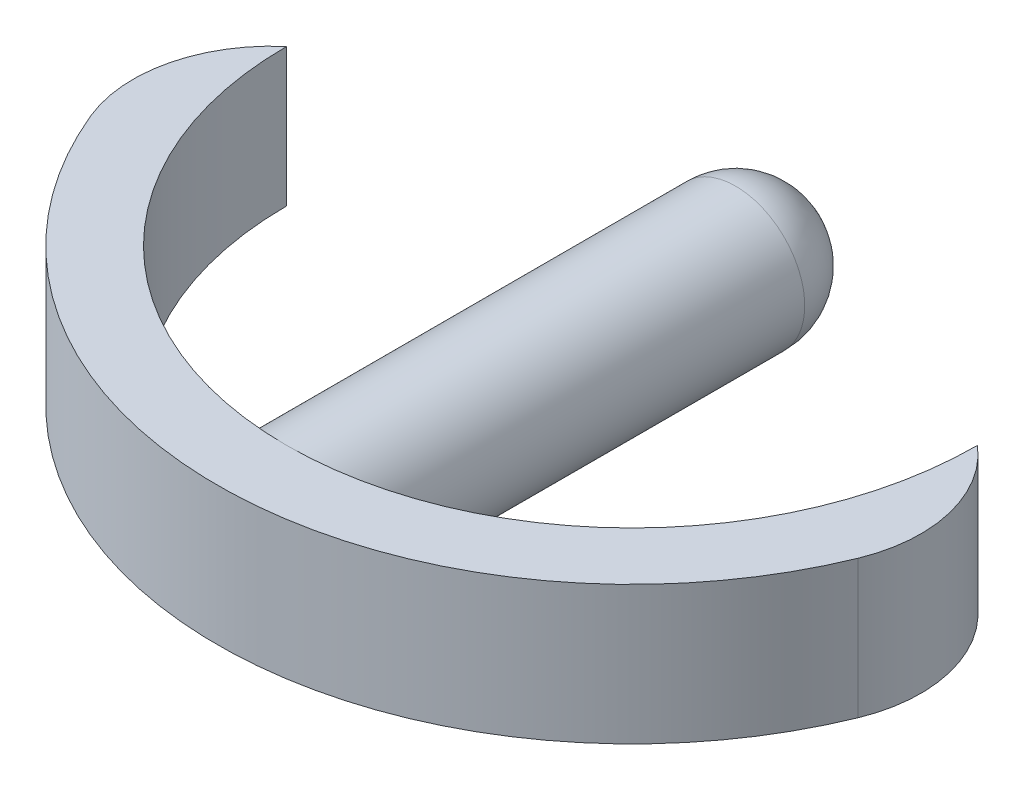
ISO-10303-21;
HEADER;
FILE_DESCRIPTION(('STEP AP214'),'2;1');
FILE_NAME('part.step','',(''),(''),'','','');
FILE_SCHEMA(('AUTOMOTIVE_DESIGN { 1 0 10303 214 1 1 1 1 }'));
ENDSEC;
DATA;
#1=APPLICATION_CONTEXT('core data for automotive mechanical design processes');
#2=APPLICATION_PROTOCOL_DEFINITION('international standard','automotive_design',2000,#1);
#3=PRODUCT_CONTEXT('',#1,'mechanical');
#4=PRODUCT('Part','Part','',(#3));
#5=PRODUCT_RELATED_PRODUCT_CATEGORY('part','',(#4));
#6=PRODUCT_DEFINITION_FORMATION('','',#4);
#7=PRODUCT_DEFINITION_CONTEXT('part definition',#1,'design');
#8=PRODUCT_DEFINITION('design','',#6,#7);
#9=PRODUCT_DEFINITION_SHAPE('','',#8);
#10=(LENGTH_UNIT() NAMED_UNIT(*) SI_UNIT(.MILLI.,.METRE.));
#11=(NAMED_UNIT(*) PLANE_ANGLE_UNIT() SI_UNIT($,.RADIAN.));
#12=(NAMED_UNIT(*) SI_UNIT($,.STERADIAN.) SOLID_ANGLE_UNIT());
#13=UNCERTAINTY_MEASURE_WITH_UNIT(LENGTH_MEASURE(1.E-05),#10,'distance_accuracy_value','');
#14=(GEOMETRIC_REPRESENTATION_CONTEXT(3) GLOBAL_UNCERTAINTY_ASSIGNED_CONTEXT((#13)) GLOBAL_UNIT_ASSIGNED_CONTEXT((#10,
#11,#12)) REPRESENTATION_CONTEXT('',''));
#15=CARTESIAN_POINT('',(0.,0.,0.));
#16=DIRECTION('',(0.,0.,1.));
#17=DIRECTION('',(1.,0.,0.));
#18=AXIS2_PLACEMENT_3D('',#15,#16,#17);
#19=CARTESIAN_POINT('',(0.,0.,0.));
#20=DIRECTION('',(0.,1.,0.));
#21=DIRECTION('',(0.,0.,1.));
#22=AXIS2_PLACEMENT_3D('',#19,#20,#21);
#23=CYLINDRICAL_SURFACE('',#22,6.35);
#24=CARTESIAN_POINT('',(0.,0.,6.35));
#25=CARTESIAN_POINT('',(-0.0705826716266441,2.59651289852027E-06,6.34999869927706));
#26=CARTESIAN_POINT('',(-0.141198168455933,0.00590403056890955,6.34881109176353));
#27=CARTESIAN_POINT('',(-0.280433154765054,0.0293350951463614,6.34418804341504));
#28=CARTESIAN_POINT('',(-0.349051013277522,0.0468739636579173,6.34075081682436));
#29=CARTESIAN_POINT('',(-0.482257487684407,0.0930164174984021,6.33201234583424));
#30=CARTESIAN_POINT('',(-0.54684989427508,0.121609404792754,6.32671288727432));
#31=CARTESIAN_POINT('',(-0.670316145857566,0.189016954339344,6.31482605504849));
#32=CARTESIAN_POINT('',(-0.729190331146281,0.227830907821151,6.30823875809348));
#33=CARTESIAN_POINT('',(-0.840350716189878,0.315135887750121,6.29440149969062));
#34=CARTESIAN_POINT('',(-0.892548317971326,0.363738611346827,6.28714446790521));
#35=CARTESIAN_POINT('',(-0.988106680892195,0.469001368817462,6.27283709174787));
#36=CARTESIAN_POINT('',(-1.03146675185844,0.5256620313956,6.26578676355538));
#37=CARTESIAN_POINT('',(-1.10849632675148,0.646069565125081,6.25262201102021));
#38=CARTESIAN_POINT('',(-1.14207409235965,0.709876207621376,6.24651668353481));
#39=CARTESIAN_POINT('',(-1.19799819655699,0.842367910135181,6.23603360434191));
#40=CARTESIAN_POINT('',(-1.22034564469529,0.911052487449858,6.23165568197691));
#41=CARTESIAN_POINT('',(-1.25288713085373,1.05039714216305,6.225194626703));
#42=CARTESIAN_POINT('',(-1.26323661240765,1.12101953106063,6.22308217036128));
#43=CARTESIAN_POINT('',(-1.27197120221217,1.26302747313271,6.22130296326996));
#44=CARTESIAN_POINT('',(-1.27035753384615,1.33441294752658,6.22163596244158));
#45=CARTESIAN_POINT('',(-1.25533730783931,1.47478342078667,6.22468339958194));
#46=CARTESIAN_POINT('',(-1.24210894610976,1.54378838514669,6.2273618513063));
#47=CARTESIAN_POINT('',(-1.20451611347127,1.67857941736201,6.23474173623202));
#48=CARTESIAN_POINT('',(-1.18015111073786,1.74436533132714,6.23944326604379));
#49=CARTESIAN_POINT('',(-1.12080647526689,1.87136438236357,6.25037635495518));
#50=CARTESIAN_POINT('',(-1.08575621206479,1.93254360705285,6.25661804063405));
#51=CARTESIAN_POINT('',(-1.0060858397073,2.04821897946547,6.26992165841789));
#52=CARTESIAN_POINT('',(-0.961464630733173,2.10271435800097,6.27698368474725));
#53=CARTESIAN_POINT('',(-0.862964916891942,2.20450334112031,6.29128816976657));
#54=CARTESIAN_POINT('',(-0.808934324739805,2.2516497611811,6.29853158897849));
#55=CARTESIAN_POINT('',(-0.693654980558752,2.33623338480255,6.31226637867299));
#56=CARTESIAN_POINT('',(-0.632406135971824,2.37367046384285,6.31875773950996));
#57=CARTESIAN_POINT('',(-0.504265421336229,2.43779993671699,6.33027296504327));
#58=CARTESIAN_POINT('',(-0.437364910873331,2.46447550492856,6.33529452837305));
#59=CARTESIAN_POINT('',(-0.299909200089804,2.50616780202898,6.3432868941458));
#60=CARTESIAN_POINT('',(-0.229354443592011,2.52118594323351,6.34625794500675));
#61=CARTESIAN_POINT('',(-0.0878578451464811,2.53892869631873,6.34977993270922));
#62=CARTESIAN_POINT('',(-0.0169422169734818,2.54185473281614,6.35037051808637));
#63=CARTESIAN_POINT('',(0.124364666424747,2.53587267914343,6.3491751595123));
#64=CARTESIAN_POINT('',(0.194755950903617,2.5269652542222,6.34738934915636));
#65=CARTESIAN_POINT('',(0.332366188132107,2.49773646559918,6.34166666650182));
#66=CARTESIAN_POINT('',(0.399607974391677,2.47751845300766,6.33774928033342));
#67=CARTESIAN_POINT('',(0.529747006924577,2.42635534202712,6.32820111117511));
#68=CARTESIAN_POINT('',(0.592643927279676,2.39540943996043,6.32257019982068));
#69=CARTESIAN_POINT('',(0.713157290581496,2.32323323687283,6.31012087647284));
#70=CARTESIAN_POINT('',(0.770699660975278,2.28188166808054,6.30328877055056));
#71=CARTESIAN_POINT('',(0.878100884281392,2.19023032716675,6.28922713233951));
#72=CARTESIAN_POINT('',(0.927958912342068,2.13992959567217,6.28199755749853));
#73=CARTESIAN_POINT('',(1.0193535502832,2.03089084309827,6.26782215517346));
#74=CARTESIAN_POINT('',(1.06075188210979,1.9720360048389,6.26088232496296));
#75=CARTESIAN_POINT('',(1.13307548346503,1.84808957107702,6.24819923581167));
#76=CARTESIAN_POINT('',(1.16400117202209,1.78299822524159,6.24245592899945));
#77=CARTESIAN_POINT('',(1.21431283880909,1.64875432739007,6.23286460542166));
#78=CARTESIAN_POINT('',(1.23375864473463,1.57962493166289,6.22900678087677));
#79=CARTESIAN_POINT('',(1.26073998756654,1.43899451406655,6.22360244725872));
#80=CARTESIAN_POINT('',(1.26827707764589,1.36749380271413,6.22205563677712));
#81=CARTESIAN_POINT('',(1.27116955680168,1.22553874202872,6.22146520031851));
#82=CARTESIAN_POINT('',(1.26674345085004,1.1550889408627,6.22237667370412));
#83=CARTESIAN_POINT('',(1.24631742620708,1.01595980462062,6.22649978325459));
#84=CARTESIAN_POINT('',(1.23031760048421,0.947280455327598,6.22971140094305));
#85=CARTESIAN_POINT('',(1.18729578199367,0.813780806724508,6.23805285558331));
#86=CARTESIAN_POINT('',(1.16030058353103,0.748951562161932,6.24317802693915));
#87=CARTESIAN_POINT('',(1.09607939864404,0.62470827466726,6.25477178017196));
#88=CARTESIAN_POINT('',(1.0588525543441,0.565294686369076,6.26124047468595));
#89=CARTESIAN_POINT('',(0.974478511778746,0.452481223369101,6.27492979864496));
#90=CARTESIAN_POINT('',(0.927173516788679,0.399200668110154,6.28216133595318));
#91=CARTESIAN_POINT('',(0.824311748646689,0.301261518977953,6.29648323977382));
#92=CARTESIAN_POINT('',(0.768753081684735,0.256604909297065,6.30357357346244));
#93=CARTESIAN_POINT('',(0.650262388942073,0.176740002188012,6.31690167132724));
#94=CARTESIAN_POINT('',(0.58725928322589,0.141635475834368,6.32312973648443));
#95=CARTESIAN_POINT('',(0.45614127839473,0.0825676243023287,6.3339360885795));
#96=CARTESIAN_POINT('',(0.38803105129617,0.0585942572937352,6.33851586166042));
#97=CARTESIAN_POINT('',(0.2664732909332,0.0271120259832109,6.34461993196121));
#98=CARTESIAN_POINT('',(0.213717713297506,0.0169631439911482,6.34662565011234));
#99=CARTESIAN_POINT('',(0.107314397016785,0.00340625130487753,6.34931615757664));
#100=CARTESIAN_POINT('',(0.0536666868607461,-1.97422740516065E-06,6.35000098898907));
#101=CARTESIAN_POINT('',(0.,0.,6.35));
#102=B_SPLINE_CURVE_WITH_KNOTS('',3,(#24,#25,#26,#27,#28,#29,#30,#31,#32,#33,#34,#35,#36,#37,
#38,#39,#40,#41,#42,#43,#44,#45,#46,#47,#48,#49,#50,#51,#52,#53,#54,#55,#56,#57,#58,#59,#60,#61,
#62,#63,#64,#65,#66,#67,#68,#69,#70,#71,#72,#73,#74,#75,#76,#77,#78,#79,#80,#81,#82,#83,#84,#85,
#86,#87,#88,#89,#90,#91,#92,#93,#94,#95,#96,#97,#98,#99,#100,#101),.UNSPECIFIED.,.T.,.F.,(4,2,2,
2,2,2,2,2,2,2,2,2,2,2,2,2,2,2,2,2,2,2,2,2,2,2,2,2,2,2,2,2,2,2,2,2,2,2,4),(0.,0.211551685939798,
0.42327150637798,0.634788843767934,0.846293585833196,1.06036449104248,1.27445210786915,
1.49048717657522,1.70650089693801,1.91968355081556,2.13284440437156,2.34279093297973,
2.55274748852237,2.76412312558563,2.97552306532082,3.19072580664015,3.40593130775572,
3.6214719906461,3.83698655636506,4.04889634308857,4.26079421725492,4.47078676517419,
4.68079504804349,4.89337433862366,5.10597643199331,5.32181598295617,5.53764689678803,
5.75234283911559,5.96701077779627,6.17778447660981,6.38855648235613,6.5988179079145,
6.80909696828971,7.02294856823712,7.23684931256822,7.45298860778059,7.66893253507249,
7.82978844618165,7.99063923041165),.UNSPECIFIED.);
#103=CARTESIAN_POINT('',(0.,0.,6.35));
#104=VERTEX_POINT('',#103);
#105=CARTESIAN_POINT('',(0.,2.54,6.35));
#106=VERTEX_POINT('',#105);
#107=EDGE_CURVE('E41',#104,#106,#102,.T.);
#108=ORIENTED_EDGE('',*,*,#107,.F.);
#109=CARTESIAN_POINT('',(0.,0.,0.));
#110=DIRECTION('',(0.,1.,0.));
#111=DIRECTION('',(0.,0.,1.));
#112=AXIS2_PLACEMENT_3D('',#109,#110,#111);
#113=CIRCLE('',#112,6.35);
#114=CARTESIAN_POINT('',(-6.35,0.,0.));
#115=VERTEX_POINT('',#114);
#116=EDGE_CURVE('E80',#115,#104,#113,.T.);
#117=ORIENTED_EDGE('',*,*,#116,.F.);
#118=DIRECTION('',(0.,1.,0.));
#119=VECTOR('',#118,1.);
#120=CARTESIAN_POINT('',(-6.35,0.,0.));
#121=LINE('',#120,#119);
#122=CARTESIAN_POINT('',(-6.35,2.54,0.));
#123=VERTEX_POINT('',#122);
#124=EDGE_CURVE('E135',#123,#115,#121,.F.);
#125=ORIENTED_EDGE('',*,*,#124,.F.);
#126=CARTESIAN_POINT('',(0.,2.54,0.));
#127=DIRECTION('',(0.,1.,0.));
#128=DIRECTION('',(0.,0.,1.));
#129=AXIS2_PLACEMENT_3D('',#126,#127,#128);
#130=CIRCLE('',#129,6.35);
#131=EDGE_CURVE('E95',#123,#106,#130,.T.);
#132=ORIENTED_EDGE('',*,*,#131,.T.);
#133=EDGE_LOOP('',(#108,#117,#125,#132));
#134=FACE_BOUND('',#133,.T.);
#135=ADVANCED_FACE('F33',(#134),#23,.F.);
#136=CARTESIAN_POINT('',(-1.27,1.27,6.22170394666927));
#137=CARTESIAN_POINT('',(-1.26999739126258,1.19943324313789,6.22170534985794));
#138=CARTESIAN_POINT('',(-1.26409852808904,1.12883362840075,6.2229175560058));
#139=CARTESIAN_POINT('',(-1.24067860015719,0.989631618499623,6.22762827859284));
#140=CARTESIAN_POINT('',(-1.2231482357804,0.921030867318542,6.23112862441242));
#141=CARTESIAN_POINT('',(-1.17703064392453,0.787860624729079,6.24000369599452));
#142=CARTESIAN_POINT('',(-1.14845441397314,0.723287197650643,6.24537655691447));
#143=CARTESIAN_POINT('',(-1.08108636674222,0.599852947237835,6.25738905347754));
#144=CARTESIAN_POINT('',(-1.04229511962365,0.540991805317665,6.26402861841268));
#145=CARTESIAN_POINT('',(-0.955013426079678,0.429817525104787,6.27793130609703));
#146=CARTESIAN_POINT('',(-0.906406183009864,0.377596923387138,6.28520127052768));
#147=CARTESIAN_POINT('',(-0.801124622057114,0.281993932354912,6.29948539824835));
#148=CARTESIAN_POINT('',(-0.744449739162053,0.238612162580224,6.306499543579));
#149=CARTESIAN_POINT('',(-0.624028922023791,0.161559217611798,6.31955551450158));
#150=CARTESIAN_POINT('',(-0.560225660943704,0.127975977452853,6.3255883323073));
#151=CARTESIAN_POINT('',(-0.427741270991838,0.0720408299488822,6.33592505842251));
#152=CARTESIAN_POINT('',(-0.359060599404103,0.0496878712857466,6.34022912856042));
#153=CARTESIAN_POINT('',(-0.219731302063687,0.0171358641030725,6.34657507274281));
#154=CARTESIAN_POINT('',(-0.149120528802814,0.00678055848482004,6.34864600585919));
#155=CARTESIAN_POINT('',(-0.00713558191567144,-0.00196970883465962,6.35039269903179));
#156=CARTESIAN_POINT('',(0.0642385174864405,-0.000365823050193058,6.35006868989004));
#157=CARTESIAN_POINT('',(0.204650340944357,0.0146382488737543,6.34708452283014));
#158=CARTESIAN_POINT('',(0.273706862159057,0.0278701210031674,6.34445769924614));
#159=CARTESIAN_POINT('',(0.408599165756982,0.0654875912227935,6.33720064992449));
#160=CARTESIAN_POINT('',(0.474434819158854,0.089873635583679,6.3325703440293));
#161=CARTESIAN_POINT('',(0.601496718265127,0.149263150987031,6.32177165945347));
#162=CARTESIAN_POINT('',(0.662691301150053,0.184332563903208,6.31559377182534));
#163=CARTESIAN_POINT('',(0.77838940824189,0.264044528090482,6.30238096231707));
#164=CARTESIAN_POINT('',(0.832892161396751,0.308688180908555,6.29534594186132));
#165=CARTESIAN_POINT('',(0.934658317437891,0.40720470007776,6.28105124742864));
#166=CARTESIAN_POINT('',(0.981778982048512,0.46122486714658,6.27378979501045));
#167=CARTESIAN_POINT('',(1.06631548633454,0.576473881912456,6.25997695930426));
#168=CARTESIAN_POINT('',(1.10373114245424,0.637702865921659,6.25342558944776));
#169=CARTESIAN_POINT('',(1.16784477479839,0.765836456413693,6.24177120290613));
#170=CARTESIAN_POINT('',(1.19451964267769,0.832752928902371,6.23667131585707));
#171=CARTESIAN_POINT('',(1.23620573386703,0.970243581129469,6.22854324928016));
#172=CARTESIAN_POINT('',(1.25121847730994,1.04081728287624,6.22551479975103));
#173=CARTESIAN_POINT('',(1.26894082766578,1.18232536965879,6.22192658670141));
#174=CARTESIAN_POINT('',(1.27185656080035,1.25323291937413,6.22132546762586));
#175=CARTESIAN_POINT('',(1.26585678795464,1.3945212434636,6.22254896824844));
#176=CARTESIAN_POINT('',(1.2569419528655,1.46490204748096,6.22437345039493));
#177=CARTESIAN_POINT('',(1.22771180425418,1.60244617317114,6.23020385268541));
#178=CARTESIAN_POINT('',(1.20750662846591,1.66963387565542,6.23418868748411));
#179=CARTESIAN_POINT('',(1.15638711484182,1.7996703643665,6.24387231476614));
#180=CARTESIAN_POINT('',(1.12547189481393,1.86251879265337,6.24957124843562));
#181=CARTESIAN_POINT('',(1.05334326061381,1.9829946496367,6.2621338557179));
#182=CARTESIAN_POINT('',(1.0120008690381,2.04054334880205,6.26901174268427));
#183=CARTESIAN_POINT('',(0.920363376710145,2.14796155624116,6.28311829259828));
#184=CARTESIAN_POINT('',(0.870067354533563,2.19783027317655,6.29034699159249));
#185=CARTESIAN_POINT('',(0.761024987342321,2.28925445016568,6.30447489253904));
#186=CARTESIAN_POINT('',(0.70216077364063,2.3306705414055,6.31136733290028));
#187=CARTESIAN_POINT('',(0.578190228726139,2.40302526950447,6.32392852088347));
#188=CARTESIAN_POINT('',(0.513084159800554,2.43396434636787,6.32959731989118));
#189=CARTESIAN_POINT('',(0.378844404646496,2.48428366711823,6.33904363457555));
#190=CARTESIAN_POINT('',(0.309736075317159,2.50372945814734,6.34283185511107));
#191=CARTESIAN_POINT('',(0.169150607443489,2.53071788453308,6.34813609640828));
#192=CARTESIAN_POINT('',(0.0976737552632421,2.53826195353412,6.34965239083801));
#193=CARTESIAN_POINT('',(-0.0442885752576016,2.54117726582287,6.35023546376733));
#194=CARTESIAN_POINT('',(-0.114769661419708,2.53675804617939,6.34934440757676));
#195=CARTESIAN_POINT('',(-0.253963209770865,2.51633488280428,6.34530155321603));
#196=CARTESIAN_POINT('',(-0.322675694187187,2.50033108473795,6.34214978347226));
#197=CARTESIAN_POINT('',(-0.456250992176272,2.45728618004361,6.33394082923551));
#198=CARTESIAN_POINT('',(-0.521122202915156,2.4302702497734,6.32888799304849));
#199=CARTESIAN_POINT('',(-0.645440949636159,2.36599445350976,6.31742097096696));
#200=CARTESIAN_POINT('',(-0.704888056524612,2.32873377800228,6.31100667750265));
#201=CARTESIAN_POINT('',(-0.817707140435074,2.24431937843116,6.29739150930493));
#202=CARTESIAN_POINT('',(-0.870965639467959,2.1970157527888,6.29017961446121));
#203=CARTESIAN_POINT('',(-0.968860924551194,2.09416619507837,6.275847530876));
#204=CARTESIAN_POINT('',(-1.01349566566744,2.0386183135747,6.26872736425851));
#205=CARTESIAN_POINT('',(-1.0933331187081,1.92013926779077,6.25530045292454));
#206=CARTESIAN_POINT('',(-1.1284290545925,1.85713501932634,6.24900329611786));
#207=CARTESIAN_POINT('',(-1.18748054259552,1.72601537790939,6.23805251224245));
#208=CARTESIAN_POINT('',(-1.2114462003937,1.65790468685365,6.23339739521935));
#209=CARTESIAN_POINT('',(-1.24290980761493,1.53636668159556,6.22718695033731));
#210=CARTESIAN_POINT('',(-1.25305045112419,1.48363251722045,6.22514356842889));
#211=CARTESIAN_POINT('',(-1.26659642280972,1.37727187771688,6.22240155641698));
#212=CARTESIAN_POINT('',(-1.27000198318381,1.32364543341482,6.22170287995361));
#213=CARTESIAN_POINT('',(-1.27,1.27,6.22170394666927));
#214=B_SPLINE_CURVE_WITH_KNOTS('',3,(#136,#137,#138,#139,#140,#141,#142,#143,#144,#145,#146,
#147,#148,#149,#150,#151,#152,#153,#154,#155,#156,#157,#158,#159,#160,#161,#162,#163,#164,#165,
#166,#167,#168,#169,#170,#171,#172,#173,#174,#175,#176,#177,#178,#179,#180,#181,#182,#183,#184,
#185,#186,#187,#188,#189,#190,#191,#192,#193,#194,#195,#196,#197,#198,#199,#200,#201,#202,#203,
#204,#205,#206,#207,#208,#209,#210,#211,#212,#213),.UNSPECIFIED.,.T.,.F.,(4,2,2,2,2,2,2,2,2,2,2,
2,2,2,2,2,2,2,2,2,2,2,2,2,2,2,2,2,2,2,2,2,2,2,2,2,2,2,4),(0.,0.211503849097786,
0.423177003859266,0.634639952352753,0.846091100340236,1.06022460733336,1.27437311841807,
1.49038818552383,1.70638302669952,1.91953196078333,2.13266035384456,2.34275362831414,
2.55285530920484,2.76428103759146,2.97573110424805,3.19086670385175,3.40600637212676,
3.62160646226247,3.83717844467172,4.04906172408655,4.26093298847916,4.47077264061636,
4.68062958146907,4.89322185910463,5.10583602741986,5.32171404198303,5.53758298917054,
5.75220863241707,5.96680842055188,6.17767392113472,6.38853677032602,6.59892021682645,
6.8093202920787,7.02311463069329,7.23695960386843,7.45310801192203,7.66905978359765,
7.82985230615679,7.99063928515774),.UNSPECIFIED.);
#215=EDGE_CURVE('E48',#104,#106,#214,.T.);
#216=ORIENTED_EDGE('',*,*,#215,.T.);
#217=CARTESIAN_POINT('',(6.35,2.54,0.));
#218=VERTEX_POINT('',#217);
#219=EDGE_CURVE('E101',#106,#218,#130,.T.);
#220=ORIENTED_EDGE('',*,*,#219,.T.);
#221=DIRECTION('',(0.,1.,0.));
#222=VECTOR('',#221,1.);
#223=CARTESIAN_POINT('',(6.35,0.,0.));
#224=LINE('',#223,#222);
#225=CARTESIAN_POINT('',(6.35,0.,0.));
#226=VERTEX_POINT('',#225);
#227=EDGE_CURVE('E94',#226,#218,#224,.T.);
#228=ORIENTED_EDGE('',*,*,#227,.F.);
#229=EDGE_CURVE('E82',#104,#226,#113,.T.);
#230=ORIENTED_EDGE('',*,*,#229,.F.);
#231=EDGE_LOOP('',(#216,#220,#228,#230));
#232=FACE_BOUND('',#231,.T.);
#233=ADVANCED_FACE('F92',(#232),#23,.F.);
#234=CARTESIAN_POINT('',(0.,2.54,0.));
#235=DIRECTION('',(0.,-1.,0.));
#236=DIRECTION('',(0.,0.,-1.));
#237=AXIS2_PLACEMENT_3D('',#234,#235,#236);
#238=CYLINDRICAL_SURFACE('',#237,7.62);
#239=CARTESIAN_POINT('',(0.,2.54,0.));
#240=DIRECTION('',(0.,1.,0.));
#241=DIRECTION('',(0.,0.,1.));
#242=AXIS2_PLACEMENT_3D('',#239,#240,#241);
#243=CIRCLE('',#242,7.62);
#244=CARTESIAN_POINT('',(-7.0485,2.54,2.89534933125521));
#245=VERTEX_POINT('',#244);
#246=CARTESIAN_POINT('',(7.0485,2.54,2.89534933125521));
#247=VERTEX_POINT('',#246);
#248=EDGE_CURVE('E137',#245,#247,#243,.T.);
#249=ORIENTED_EDGE('',*,*,#248,.F.);
#250=DIRECTION('',(0.,-1.,0.));
#251=VECTOR('',#250,1.);
#252=CARTESIAN_POINT('',(-7.0485,2.54,2.89534933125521));
#253=LINE('',#252,#251);
#254=CARTESIAN_POINT('',(-7.0485,0.,2.89534933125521));
#255=VERTEX_POINT('',#254);
#256=EDGE_CURVE('E124',#245,#255,#253,.T.);
#257=ORIENTED_EDGE('',*,*,#256,.T.);
#258=CARTESIAN_POINT('',(0.,0.,0.));
#259=DIRECTION('',(0.,1.,0.));
#260=DIRECTION('',(0.,0.,1.));
#261=AXIS2_PLACEMENT_3D('',#258,#259,#260);
#262=CIRCLE('',#261,7.62);
#263=CARTESIAN_POINT('',(7.0485,0.,2.89534933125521));
#264=VERTEX_POINT('',#263);
#265=EDGE_CURVE('E90',#255,#264,#262,.T.);
#266=ORIENTED_EDGE('',*,*,#265,.T.);
#267=DIRECTION('',(0.,-1.,0.));
#268=VECTOR('',#267,1.);
#269=CARTESIAN_POINT('',(7.0485,2.54,2.89534933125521));
#270=LINE('',#269,#268);
#271=EDGE_CURVE('E126',#264,#247,#270,.F.);
#272=ORIENTED_EDGE('',*,*,#271,.T.);
#273=EDGE_LOOP('',(#249,#257,#266,#272));
#274=FACE_BOUND('',#273,.T.);
#275=ADVANCED_FACE('F145',(#274),#238,.T.);
#276=CARTESIAN_POINT('',(0.,2.54,0.));
#277=DIRECTION('',(0.,1.,0.));
#278=DIRECTION('',(0.,0.,1.));
#279=AXIS2_PLACEMENT_3D('',#276,#277,#278);
#280=PLANE('',#279);
#281=ORIENTED_EDGE('',*,*,#131,.F.);
#282=CARTESIAN_POINT('',(-4.699,2.54,1.93023288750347));
#283=DIRECTION('',(0.,1.,0.));
#284=DIRECTION('',(0.,0.,1.));
#285=AXIS2_PLACEMENT_3D('',#282,#283,#284);
#286=CIRCLE('',#285,2.54);
#287=EDGE_CURVE('E129',#123,#245,#286,.T.);
#288=ORIENTED_EDGE('',*,*,#287,.T.);
#289=ORIENTED_EDGE('',*,*,#248,.T.);
#290=CARTESIAN_POINT('',(4.699,2.54,1.93023288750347));
#291=DIRECTION('',(0.,1.,0.));
#292=DIRECTION('',(0.,0.,1.));
#293=AXIS2_PLACEMENT_3D('',#290,#291,#292);
#294=CIRCLE('',#293,2.54);
#295=EDGE_CURVE('E131',#247,#218,#294,.T.);
#296=ORIENTED_EDGE('',*,*,#295,.T.);
#297=ORIENTED_EDGE('',*,*,#219,.F.);
#298=EDGE_LOOP('',(#281,#288,#289,#296,#297));
#299=FACE_BOUND('',#298,.T.);
#300=ADVANCED_FACE('F142',(#299),#280,.T.);
#301=CARTESIAN_POINT('',(0.,0.,0.));
#302=DIRECTION('',(0.,1.,0.));
#303=DIRECTION('',(0.,0.,1.));
#304=AXIS2_PLACEMENT_3D('',#301,#302,#303);
#305=PLANE('',#304);
#306=ORIENTED_EDGE('',*,*,#265,.F.);
#307=CARTESIAN_POINT('',(-4.699,0.,1.93023288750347));
#308=DIRECTION('',(0.,1.,0.));
#309=DIRECTION('',(0.,0.,1.));
#310=AXIS2_PLACEMENT_3D('',#307,#308,#309);
#311=CIRCLE('',#310,2.54);
#312=EDGE_CURVE('E85',#255,#115,#311,.F.);
#313=ORIENTED_EDGE('',*,*,#312,.T.);
#314=ORIENTED_EDGE('',*,*,#116,.T.);
#315=ORIENTED_EDGE('',*,*,#229,.T.);
#316=CARTESIAN_POINT('',(4.699,0.,1.93023288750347));
#317=DIRECTION('',(0.,1.,0.));
#318=DIRECTION('',(0.,0.,1.));
#319=AXIS2_PLACEMENT_3D('',#316,#317,#318);
#320=CIRCLE('',#319,2.54);
#321=EDGE_CURVE('E56',#226,#264,#320,.F.);
#322=ORIENTED_EDGE('',*,*,#321,.T.);
#323=EDGE_LOOP('',(#306,#313,#314,#315,#322));
#324=FACE_BOUND('',#323,.T.);
#325=ADVANCED_FACE('F81',(#324),#305,.F.);
#326=CARTESIAN_POINT('',(-4.699,2.54,1.93023288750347));
#327=DIRECTION('',(0.,-1.,0.));
#328=DIRECTION('',(0.,0.,-1.));
#329=AXIS2_PLACEMENT_3D('',#326,#327,#328);
#330=CYLINDRICAL_SURFACE('',#329,2.54);
#331=ORIENTED_EDGE('',*,*,#312,.F.);
#332=ORIENTED_EDGE('',*,*,#256,.F.);
#333=ORIENTED_EDGE('',*,*,#287,.F.);
#334=ORIENTED_EDGE('',*,*,#124,.T.);
#335=EDGE_LOOP('',(#331,#332,#333,#334));
#336=FACE_BOUND('',#335,.T.);
#337=ADVANCED_FACE('F148',(#336),#330,.T.);
#338=CARTESIAN_POINT('',(4.699,0.,1.93023288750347));
#339=DIRECTION('',(0.,-1.,0.));
#340=DIRECTION('',(0.,0.,-1.));
#341=AXIS2_PLACEMENT_3D('',#338,#339,#340);
#342=CYLINDRICAL_SURFACE('',#341,2.54);
#343=ORIENTED_EDGE('',*,*,#321,.F.);
#344=ORIENTED_EDGE('',*,*,#227,.T.);
#345=ORIENTED_EDGE('',*,*,#295,.F.);
#346=ORIENTED_EDGE('',*,*,#271,.F.);
#347=EDGE_LOOP('',(#343,#344,#345,#346));
#348=FACE_BOUND('',#347,.T.);
#349=ADVANCED_FACE('F113',(#348),#342,.T.);
#350=CARTESIAN_POINT('',(0.,1.27,7.622));
#351=DIRECTION('',(0.,0.,-1.));
#352=DIRECTION('',(-1.,0.,0.));
#353=AXIS2_PLACEMENT_3D('',#350,#351,#352);
#354=CYLINDRICAL_SURFACE('',#353,1.27);
#355=CARTESIAN_POINT('',(0.,1.27,-1.905));
#356=DIRECTION('',(0.,0.,-1.));
#357=DIRECTION('',(-1.,0.,0.));
#358=AXIS2_PLACEMENT_3D('',#355,#356,#357);
#359=CIRCLE('',#358,1.27);
#360=CARTESIAN_POINT('',(-1.27,1.27,-1.905));
#361=VERTEX_POINT('',#360);
#362=EDGE_CURVE('E11',#361,#361,#359,.F.);
#363=ORIENTED_EDGE('',*,*,#362,.T.);
#364=EDGE_LOOP('',(#363));
#365=FACE_BOUND('',#364,.T.);
#366=ORIENTED_EDGE('',*,*,#215,.F.);
#367=ORIENTED_EDGE('',*,*,#107,.T.);
#368=EDGE_LOOP('',(#366,#367));
#369=FACE_BOUND('',#368,.T.);
#370=ADVANCED_FACE('F100',(#365,#369),#354,.T.);
#371=CARTESIAN_POINT('',(0.,1.27,-1.905));
#372=DIRECTION('',(0.,0.,-1.));
#373=DIRECTION('',(-1.,0.,0.));
#374=AXIS2_PLACEMENT_3D('',#371,#372,#373);
#375=SPHERICAL_SURFACE('',#374,1.27);
#376=ORIENTED_EDGE('',*,*,#362,.F.);
#377=EDGE_LOOP('',(#376));
#378=FACE_BOUND('',#377,.T.);
#379=ADVANCED_FACE('F35',(#378),#375,.T.);
#380=CLOSED_SHELL('',(#135,#233,#275,#300,#325,#337,#349,#370,#379));
#381=MANIFOLD_SOLID_BREP('B2',#380);
#382=ADVANCED_BREP_SHAPE_REPRESENTATION('',(#18,#381),#14);
#383=SHAPE_DEFINITION_REPRESENTATION(#9,#382);
ENDSEC;
END-ISO-10303-21;
